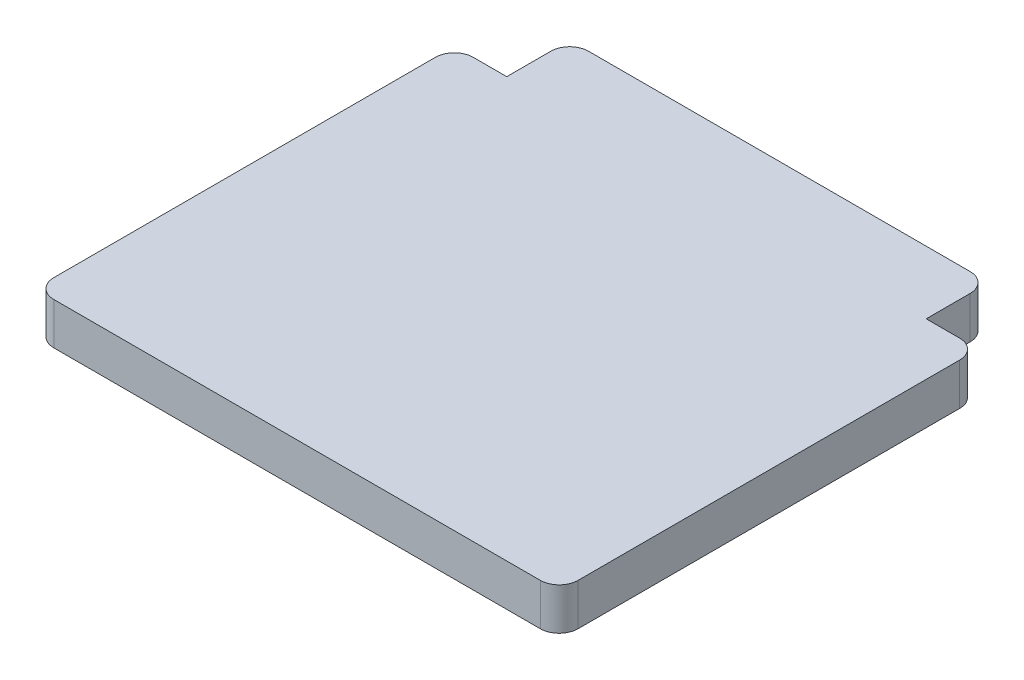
ISO-10303-21;
HEADER;
FILE_DESCRIPTION(('STEP AP214'),'2;1');
FILE_NAME('part.step','',(''),(''),'','','');
FILE_SCHEMA(('AUTOMOTIVE_DESIGN { 1 0 10303 214 1 1 1 1 }'));
ENDSEC;
DATA;
#1=APPLICATION_CONTEXT('core data for automotive mechanical design processes');
#2=APPLICATION_PROTOCOL_DEFINITION('international standard','automotive_design',2000,#1);
#3=PRODUCT_CONTEXT('',#1,'mechanical');
#4=PRODUCT('Part','Part','',(#3));
#5=PRODUCT_RELATED_PRODUCT_CATEGORY('part','',(#4));
#6=PRODUCT_DEFINITION_FORMATION('','',#4);
#7=PRODUCT_DEFINITION_CONTEXT('part definition',#1,'design');
#8=PRODUCT_DEFINITION('design','',#6,#7);
#9=PRODUCT_DEFINITION_SHAPE('','',#8);
#10=(LENGTH_UNIT() NAMED_UNIT(*) SI_UNIT(.MILLI.,.METRE.));
#11=(NAMED_UNIT(*) PLANE_ANGLE_UNIT() SI_UNIT($,.RADIAN.));
#12=(NAMED_UNIT(*) SI_UNIT($,.STERADIAN.) SOLID_ANGLE_UNIT());
#13=UNCERTAINTY_MEASURE_WITH_UNIT(LENGTH_MEASURE(1.E-05),#10,'distance_accuracy_value','');
#14=(GEOMETRIC_REPRESENTATION_CONTEXT(3) GLOBAL_UNCERTAINTY_ASSIGNED_CONTEXT((#13)) GLOBAL_UNIT_ASSIGNED_CONTEXT((#10,
#11,#12)) REPRESENTATION_CONTEXT('',''));
#15=CARTESIAN_POINT('',(0.,0.,0.));
#16=DIRECTION('',(0.,0.,1.));
#17=DIRECTION('',(1.,0.,0.));
#18=AXIS2_PLACEMENT_3D('',#15,#16,#17);
#19=CARTESIAN_POINT('',(0.,2.,-10.));
#20=DIRECTION('',(0.,0.,-1.));
#21=DIRECTION('',(-1.,0.,0.));
#22=AXIS2_PLACEMENT_3D('',#19,#20,#21);
#23=PLANE('',#22);
#24=DIRECTION('',(1.,0.,0.));
#25=VECTOR('',#24,1.);
#26=CARTESIAN_POINT('',(0.,0.,-10.));
#27=LINE('',#26,#25);
#28=CARTESIAN_POINT('',(10.,0.,-10.));
#29=VERTEX_POINT('',#28);
#30=CARTESIAN_POINT('',(11.5997580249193,0.,-10.));
#31=VERTEX_POINT('',#30);
#32=EDGE_CURVE('E164',#29,#31,#27,.T.);
#33=ORIENTED_EDGE('',*,*,#32,.F.);
#34=DIRECTION('',(0.,-1.,0.));
#35=VECTOR('',#34,1.);
#36=CARTESIAN_POINT('',(10.,2.,-10.));
#37=LINE('',#36,#35);
#38=CARTESIAN_POINT('',(10.,2.,-10.));
#39=VERTEX_POINT('',#38);
#40=EDGE_CURVE('E11',#39,#29,#37,.T.);
#41=ORIENTED_EDGE('',*,*,#40,.F.);
#42=DIRECTION('',(1.,0.,0.));
#43=VECTOR('',#42,1.);
#44=CARTESIAN_POINT('',(0.,2.,-10.));
#45=LINE('',#44,#43);
#46=CARTESIAN_POINT('',(11.5997580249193,2.,-10.));
#47=VERTEX_POINT('',#46);
#48=EDGE_CURVE('E195',#39,#47,#45,.T.);
#49=ORIENTED_EDGE('',*,*,#48,.T.);
#50=DIRECTION('',(0.,-1.,0.));
#51=VECTOR('',#50,1.);
#52=CARTESIAN_POINT('',(11.5997580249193,2.,-10.));
#53=LINE('',#52,#51);
#54=EDGE_CURVE('E51',#47,#31,#53,.T.);
#55=ORIENTED_EDGE('',*,*,#54,.T.);
#56=EDGE_LOOP('',(#33,#41,#49,#55));
#57=FACE_BOUND('',#56,.T.);
#58=ADVANCED_FACE('F34',(#57),#23,.T.);
#59=CARTESIAN_POINT('',(10.,2.,0.));
#60=DIRECTION('',(1.,0.,0.));
#61=DIRECTION('',(0.,0.,-1.));
#62=AXIS2_PLACEMENT_3D('',#59,#60,#61);
#63=PLANE('',#62);
#64=DIRECTION('',(0.,0.,1.));
#65=VECTOR('',#64,1.);
#66=CARTESIAN_POINT('',(10.,0.,0.));
#67=LINE('',#66,#65);
#68=CARTESIAN_POINT('',(10.,0.,-12.0997580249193));
#69=VERTEX_POINT('',#68);
#70=EDGE_CURVE('E166',#69,#29,#67,.T.);
#71=ORIENTED_EDGE('',*,*,#70,.F.);
#72=DIRECTION('',(0.,-1.,0.));
#73=VECTOR('',#72,1.);
#74=CARTESIAN_POINT('',(10.,2.,-12.0997580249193));
#75=LINE('',#74,#73);
#76=CARTESIAN_POINT('',(10.,2.,-12.0997580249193));
#77=VERTEX_POINT('',#76);
#78=EDGE_CURVE('E43',#77,#69,#75,.T.);
#79=ORIENTED_EDGE('',*,*,#78,.F.);
#80=DIRECTION('',(0.,0.,1.));
#81=VECTOR('',#80,1.);
#82=CARTESIAN_POINT('',(10.,2.,0.));
#83=LINE('',#82,#81);
#84=EDGE_CURVE('E239',#77,#39,#83,.T.);
#85=ORIENTED_EDGE('',*,*,#84,.T.);
#86=ORIENTED_EDGE('',*,*,#40,.T.);
#87=EDGE_LOOP('',(#71,#79,#85,#86));
#88=FACE_BOUND('',#87,.T.);
#89=ADVANCED_FACE('F36',(#88),#63,.T.);
#90=CARTESIAN_POINT('',(9.09975802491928,2.,-12.0997580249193));
#91=DIRECTION('',(0.,-1.,0.));
#92=DIRECTION('',(0.,0.,-1.));
#93=AXIS2_PLACEMENT_3D('',#90,#91,#92);
#94=CYLINDRICAL_SURFACE('',#93,0.900241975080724);
#95=CARTESIAN_POINT('',(9.09975802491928,0.,-12.0997580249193));
#96=DIRECTION('',(0.,1.,0.));
#97=DIRECTION('',(0.,0.,1.));
#98=AXIS2_PLACEMENT_3D('',#95,#96,#97);
#99=CIRCLE('',#98,0.900241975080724);
#100=CARTESIAN_POINT('',(9.09975802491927,0.,-13.));
#101=VERTEX_POINT('',#100);
#102=EDGE_CURVE('E170',#101,#69,#99,.F.);
#103=ORIENTED_EDGE('',*,*,#102,.F.);
#104=DIRECTION('',(0.,-1.,0.));
#105=VECTOR('',#104,1.);
#106=CARTESIAN_POINT('',(9.09975802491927,2.,-13.));
#107=LINE('',#106,#105);
#108=CARTESIAN_POINT('',(9.09975802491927,2.,-13.));
#109=VERTEX_POINT('',#108);
#110=EDGE_CURVE('E217',#109,#101,#107,.T.);
#111=ORIENTED_EDGE('',*,*,#110,.F.);
#112=CARTESIAN_POINT('',(9.09975802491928,2.,-12.0997580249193));
#113=DIRECTION('',(0.,1.,0.));
#114=DIRECTION('',(0.,0.,1.));
#115=AXIS2_PLACEMENT_3D('',#112,#113,#114);
#116=CIRCLE('',#115,0.900241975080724);
#117=EDGE_CURVE('E224',#109,#77,#116,.F.);
#118=ORIENTED_EDGE('',*,*,#117,.T.);
#119=ORIENTED_EDGE('',*,*,#78,.T.);
#120=EDGE_LOOP('',(#103,#111,#118,#119));
#121=FACE_BOUND('',#120,.T.);
#122=ADVANCED_FACE('F222',(#121),#94,.T.);
#123=CARTESIAN_POINT('',(0.,2.,-13.));
#124=DIRECTION('',(0.,0.,-1.));
#125=DIRECTION('',(-1.,0.,0.));
#126=AXIS2_PLACEMENT_3D('',#123,#124,#125);
#127=PLANE('',#126);
#128=DIRECTION('',(1.,0.,0.));
#129=VECTOR('',#128,1.);
#130=CARTESIAN_POINT('',(0.,0.,-13.));
#131=LINE('',#130,#129);
#132=CARTESIAN_POINT('',(-9.09975802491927,0.,-13.));
#133=VERTEX_POINT('',#132);
#134=EDGE_CURVE('E173',#133,#101,#131,.T.);
#135=ORIENTED_EDGE('',*,*,#134,.F.);
#136=DIRECTION('',(0.,-1.,0.));
#137=VECTOR('',#136,1.);
#138=CARTESIAN_POINT('',(-9.09975802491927,2.,-13.));
#139=LINE('',#138,#137);
#140=CARTESIAN_POINT('',(-9.09975802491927,2.,-13.));
#141=VERTEX_POINT('',#140);
#142=EDGE_CURVE('E215',#141,#133,#139,.T.);
#143=ORIENTED_EDGE('',*,*,#142,.F.);
#144=DIRECTION('',(1.,0.,0.));
#145=VECTOR('',#144,1.);
#146=CARTESIAN_POINT('',(0.,2.,-13.));
#147=LINE('',#146,#145);
#148=EDGE_CURVE('E238',#141,#109,#147,.T.);
#149=ORIENTED_EDGE('',*,*,#148,.T.);
#150=ORIENTED_EDGE('',*,*,#110,.T.);
#151=EDGE_LOOP('',(#135,#143,#149,#150));
#152=FACE_BOUND('',#151,.T.);
#153=ADVANCED_FACE('F234',(#152),#127,.T.);
#154=CARTESIAN_POINT('',(-9.09975802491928,2.,-12.0997580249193));
#155=DIRECTION('',(0.,-1.,0.));
#156=DIRECTION('',(0.,0.,-1.));
#157=AXIS2_PLACEMENT_3D('',#154,#155,#156);
#158=CYLINDRICAL_SURFACE('',#157,0.900241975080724);
#159=CARTESIAN_POINT('',(-9.09975802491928,0.,-12.0997580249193));
#160=DIRECTION('',(0.,1.,0.));
#161=DIRECTION('',(0.,0.,1.));
#162=AXIS2_PLACEMENT_3D('',#159,#160,#161);
#163=CIRCLE('',#162,0.900241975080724);
#164=CARTESIAN_POINT('',(-10.,0.,-12.0997580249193));
#165=VERTEX_POINT('',#164);
#166=EDGE_CURVE('E176',#133,#165,#163,.T.);
#167=ORIENTED_EDGE('',*,*,#166,.T.);
#168=DIRECTION('',(0.,-1.,0.));
#169=VECTOR('',#168,1.);
#170=CARTESIAN_POINT('',(-10.,2.,-12.0997580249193));
#171=LINE('',#170,#169);
#172=CARTESIAN_POINT('',(-10.,2.,-12.0997580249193));
#173=VERTEX_POINT('',#172);
#174=EDGE_CURVE('E212',#173,#165,#171,.T.);
#175=ORIENTED_EDGE('',*,*,#174,.F.);
#176=CARTESIAN_POINT('',(-9.09975802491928,2.,-12.0997580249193));
#177=DIRECTION('',(0.,1.,0.));
#178=DIRECTION('',(0.,0.,1.));
#179=AXIS2_PLACEMENT_3D('',#176,#177,#178);
#180=CIRCLE('',#179,0.900241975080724);
#181=EDGE_CURVE('E241',#141,#173,#180,.T.);
#182=ORIENTED_EDGE('',*,*,#181,.F.);
#183=ORIENTED_EDGE('',*,*,#142,.T.);
#184=EDGE_LOOP('',(#167,#175,#182,#183));
#185=FACE_BOUND('',#184,.T.);
#186=ADVANCED_FACE('F293',(#185),#158,.T.);
#187=CARTESIAN_POINT('',(-10.,2.,0.));
#188=DIRECTION('',(1.,0.,0.));
#189=DIRECTION('',(0.,0.,-1.));
#190=AXIS2_PLACEMENT_3D('',#187,#188,#189);
#191=PLANE('',#190);
#192=DIRECTION('',(0.,0.,1.));
#193=VECTOR('',#192,1.);
#194=CARTESIAN_POINT('',(-10.,0.,0.));
#195=LINE('',#194,#193);
#196=CARTESIAN_POINT('',(-10.,0.,-10.));
#197=VERTEX_POINT('',#196);
#198=EDGE_CURVE('E178',#165,#197,#195,.T.);
#199=ORIENTED_EDGE('',*,*,#198,.T.);
#200=DIRECTION('',(0.,-1.,0.));
#201=VECTOR('',#200,1.);
#202=CARTESIAN_POINT('',(-10.,2.,-10.));
#203=LINE('',#202,#201);
#204=CARTESIAN_POINT('',(-10.,2.,-10.));
#205=VERTEX_POINT('',#204);
#206=EDGE_CURVE('E210',#205,#197,#203,.T.);
#207=ORIENTED_EDGE('',*,*,#206,.F.);
#208=DIRECTION('',(0.,0.,1.));
#209=VECTOR('',#208,1.);
#210=CARTESIAN_POINT('',(-10.,2.,0.));
#211=LINE('',#210,#209);
#212=EDGE_CURVE('E247',#173,#205,#211,.T.);
#213=ORIENTED_EDGE('',*,*,#212,.F.);
#214=ORIENTED_EDGE('',*,*,#174,.T.);
#215=EDGE_LOOP('',(#199,#207,#213,#214));
#216=FACE_BOUND('',#215,.T.);
#217=ADVANCED_FACE('F285',(#216),#191,.F.);
#218=CARTESIAN_POINT('',(-11.5997580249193,0.,-10.));
#219=VERTEX_POINT('',#218);
#220=EDGE_CURVE('E167',#219,#197,#27,.T.);
#221=ORIENTED_EDGE('',*,*,#220,.F.);
#222=DIRECTION('',(0.,-1.,0.));
#223=VECTOR('',#222,1.);
#224=CARTESIAN_POINT('',(-11.5997580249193,2.,-10.));
#225=LINE('',#224,#223);
#226=CARTESIAN_POINT('',(-11.5997580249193,2.,-10.));
#227=VERTEX_POINT('',#226);
#228=EDGE_CURVE('E208',#227,#219,#225,.T.);
#229=ORIENTED_EDGE('',*,*,#228,.F.);
#230=EDGE_CURVE('E249',#227,#205,#45,.T.);
#231=ORIENTED_EDGE('',*,*,#230,.T.);
#232=ORIENTED_EDGE('',*,*,#206,.T.);
#233=EDGE_LOOP('',(#221,#229,#231,#232));
#234=FACE_BOUND('',#233,.T.);
#235=ADVANCED_FACE('F277',(#234),#23,.T.);
#236=CARTESIAN_POINT('',(-11.5997580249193,2.,-9.09975802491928));
#237=DIRECTION('',(0.,-1.,0.));
#238=DIRECTION('',(0.,0.,-1.));
#239=AXIS2_PLACEMENT_3D('',#236,#237,#238);
#240=CYLINDRICAL_SURFACE('',#239,0.900241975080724);
#241=CARTESIAN_POINT('',(-11.5997580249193,0.,-9.09975802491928));
#242=DIRECTION('',(0.,1.,0.));
#243=DIRECTION('',(0.,0.,1.));
#244=AXIS2_PLACEMENT_3D('',#241,#242,#243);
#245=CIRCLE('',#244,0.900241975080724);
#246=CARTESIAN_POINT('',(-12.5,0.,-9.09975802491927));
#247=VERTEX_POINT('',#246);
#248=EDGE_CURVE('E181',#219,#247,#245,.T.);
#249=ORIENTED_EDGE('',*,*,#248,.T.);
#250=DIRECTION('',(0.,-1.,0.));
#251=VECTOR('',#250,1.);
#252=CARTESIAN_POINT('',(-12.5,2.,-9.09975802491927));
#253=LINE('',#252,#251);
#254=CARTESIAN_POINT('',(-12.5,2.,-9.09975802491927));
#255=VERTEX_POINT('',#254);
#256=EDGE_CURVE('E205',#255,#247,#253,.T.);
#257=ORIENTED_EDGE('',*,*,#256,.F.);
#258=CARTESIAN_POINT('',(-11.5997580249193,2.,-9.09975802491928));
#259=DIRECTION('',(0.,1.,0.));
#260=DIRECTION('',(0.,0.,1.));
#261=AXIS2_PLACEMENT_3D('',#258,#259,#260);
#262=CIRCLE('',#261,0.900241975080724);
#263=EDGE_CURVE('E250',#227,#255,#262,.T.);
#264=ORIENTED_EDGE('',*,*,#263,.F.);
#265=ORIENTED_EDGE('',*,*,#228,.T.);
#266=EDGE_LOOP('',(#249,#257,#264,#265));
#267=FACE_BOUND('',#266,.T.);
#268=ADVANCED_FACE('F284',(#267),#240,.T.);
#269=CARTESIAN_POINT('',(-12.5,2.,0.));
#270=DIRECTION('',(1.,0.,0.));
#271=DIRECTION('',(0.,0.,-1.));
#272=AXIS2_PLACEMENT_3D('',#269,#270,#271);
#273=PLANE('',#272);
#274=DIRECTION('',(0.,0.,1.));
#275=VECTOR('',#274,1.);
#276=CARTESIAN_POINT('',(-12.5,0.,0.));
#277=LINE('',#276,#275);
#278=CARTESIAN_POINT('',(-12.5,0.,9.09975802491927));
#279=VERTEX_POINT('',#278);
#280=EDGE_CURVE('E183',#247,#279,#277,.T.);
#281=ORIENTED_EDGE('',*,*,#280,.T.);
#282=DIRECTION('',(0.,-1.,0.));
#283=VECTOR('',#282,1.);
#284=CARTESIAN_POINT('',(-12.5,2.,9.09975802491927));
#285=LINE('',#284,#283);
#286=CARTESIAN_POINT('',(-12.5,2.,9.09975802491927));
#287=VERTEX_POINT('',#286);
#288=EDGE_CURVE('E202',#287,#279,#285,.T.);
#289=ORIENTED_EDGE('',*,*,#288,.F.);
#290=DIRECTION('',(0.,0.,1.));
#291=VECTOR('',#290,1.);
#292=CARTESIAN_POINT('',(-12.5,2.,0.));
#293=LINE('',#292,#291);
#294=EDGE_CURVE('E252',#255,#287,#293,.T.);
#295=ORIENTED_EDGE('',*,*,#294,.F.);
#296=ORIENTED_EDGE('',*,*,#256,.T.);
#297=EDGE_LOOP('',(#281,#289,#295,#296));
#298=FACE_BOUND('',#297,.T.);
#299=ADVANCED_FACE('F291',(#298),#273,.F.);
#300=CARTESIAN_POINT('',(-11.5997580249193,2.,9.09975802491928));
#301=DIRECTION('',(0.,-1.,0.));
#302=DIRECTION('',(0.,0.,-1.));
#303=AXIS2_PLACEMENT_3D('',#300,#301,#302);
#304=CYLINDRICAL_SURFACE('',#303,0.900241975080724);
#305=CARTESIAN_POINT('',(-11.5997580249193,0.,9.09975802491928));
#306=DIRECTION('',(0.,1.,0.));
#307=DIRECTION('',(0.,0.,1.));
#308=AXIS2_PLACEMENT_3D('',#305,#306,#307);
#309=CIRCLE('',#308,0.900241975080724);
#310=CARTESIAN_POINT('',(-11.5997580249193,0.,10.));
#311=VERTEX_POINT('',#310);
#312=EDGE_CURVE('E185',#279,#311,#309,.T.);
#313=ORIENTED_EDGE('',*,*,#312,.T.);
#314=DIRECTION('',(0.,-1.,0.));
#315=VECTOR('',#314,1.);
#316=CARTESIAN_POINT('',(-11.5997580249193,2.,10.));
#317=LINE('',#316,#315);
#318=CARTESIAN_POINT('',(-11.5997580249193,2.,10.));
#319=VERTEX_POINT('',#318);
#320=EDGE_CURVE('E199',#319,#311,#317,.T.);
#321=ORIENTED_EDGE('',*,*,#320,.F.);
#322=CARTESIAN_POINT('',(-11.5997580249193,2.,9.09975802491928));
#323=DIRECTION('',(0.,1.,0.));
#324=DIRECTION('',(0.,0.,1.));
#325=AXIS2_PLACEMENT_3D('',#322,#323,#324);
#326=CIRCLE('',#325,0.900241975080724);
#327=EDGE_CURVE('E254',#287,#319,#326,.T.);
#328=ORIENTED_EDGE('',*,*,#327,.F.);
#329=ORIENTED_EDGE('',*,*,#288,.T.);
#330=EDGE_LOOP('',(#313,#321,#328,#329));
#331=FACE_BOUND('',#330,.T.);
#332=ADVANCED_FACE('F260',(#331),#304,.T.);
#333=CARTESIAN_POINT('',(0.,2.,10.));
#334=DIRECTION('',(0.,0.,-1.));
#335=DIRECTION('',(-1.,0.,0.));
#336=AXIS2_PLACEMENT_3D('',#333,#334,#335);
#337=PLANE('',#336);
#338=DIRECTION('',(1.,0.,0.));
#339=VECTOR('',#338,1.);
#340=CARTESIAN_POINT('',(0.,0.,10.));
#341=LINE('',#340,#339);
#342=CARTESIAN_POINT('',(11.5997580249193,0.,10.));
#343=VERTEX_POINT('',#342);
#344=EDGE_CURVE('E187',#311,#343,#341,.T.);
#345=ORIENTED_EDGE('',*,*,#344,.T.);
#346=DIRECTION('',(0.,-1.,0.));
#347=VECTOR('',#346,1.);
#348=CARTESIAN_POINT('',(11.5997580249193,2.,10.));
#349=LINE('',#348,#347);
#350=CARTESIAN_POINT('',(11.5997580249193,2.,10.));
#351=VERTEX_POINT('',#350);
#352=EDGE_CURVE('E156',#351,#343,#349,.T.);
#353=ORIENTED_EDGE('',*,*,#352,.F.);
#354=DIRECTION('',(1.,0.,0.));
#355=VECTOR('',#354,1.);
#356=CARTESIAN_POINT('',(0.,2.,10.));
#357=LINE('',#356,#355);
#358=EDGE_CURVE('E144',#319,#351,#357,.T.);
#359=ORIENTED_EDGE('',*,*,#358,.F.);
#360=ORIENTED_EDGE('',*,*,#320,.T.);
#361=EDGE_LOOP('',(#345,#353,#359,#360));
#362=FACE_BOUND('',#361,.T.);
#363=ADVANCED_FACE('F264',(#362),#337,.F.);
#364=CARTESIAN_POINT('',(11.5997580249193,2.,9.09975802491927));
#365=DIRECTION('',(0.,-1.,0.));
#366=DIRECTION('',(0.,0.,-1.));
#367=AXIS2_PLACEMENT_3D('',#364,#365,#366);
#368=CYLINDRICAL_SURFACE('',#367,0.900241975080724);
#369=CARTESIAN_POINT('',(11.5997580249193,0.,9.09975802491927));
#370=DIRECTION('',(0.,1.,0.));
#371=DIRECTION('',(0.,0.,1.));
#372=AXIS2_PLACEMENT_3D('',#369,#370,#371);
#373=CIRCLE('',#372,0.900241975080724);
#374=CARTESIAN_POINT('',(12.5,0.,9.09975802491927));
#375=VERTEX_POINT('',#374);
#376=EDGE_CURVE('E153',#343,#375,#373,.T.);
#377=ORIENTED_EDGE('',*,*,#376,.T.);
#378=DIRECTION('',(0.,-1.,0.));
#379=VECTOR('',#378,1.);
#380=CARTESIAN_POINT('',(12.5,2.,9.09975802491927));
#381=LINE('',#380,#379);
#382=CARTESIAN_POINT('',(12.5,2.,9.09975802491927));
#383=VERTEX_POINT('',#382);
#384=EDGE_CURVE('E150',#383,#375,#381,.T.);
#385=ORIENTED_EDGE('',*,*,#384,.F.);
#386=CARTESIAN_POINT('',(11.5997580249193,2.,9.09975802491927));
#387=DIRECTION('',(0.,1.,0.));
#388=DIRECTION('',(0.,0.,1.));
#389=AXIS2_PLACEMENT_3D('',#386,#387,#388);
#390=CIRCLE('',#389,0.900241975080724);
#391=EDGE_CURVE('E137',#351,#383,#390,.T.);
#392=ORIENTED_EDGE('',*,*,#391,.F.);
#393=ORIENTED_EDGE('',*,*,#352,.T.);
#394=EDGE_LOOP('',(#377,#385,#392,#393));
#395=FACE_BOUND('',#394,.T.);
#396=ADVANCED_FACE('F151',(#395),#368,.T.);
#397=CARTESIAN_POINT('',(12.5,2.,0.));
#398=DIRECTION('',(1.,0.,0.));
#399=DIRECTION('',(0.,0.,-1.));
#400=AXIS2_PLACEMENT_3D('',#397,#398,#399);
#401=PLANE('',#400);
#402=DIRECTION('',(0.,0.,1.));
#403=VECTOR('',#402,1.);
#404=CARTESIAN_POINT('',(12.5,0.,0.));
#405=LINE('',#404,#403);
#406=CARTESIAN_POINT('',(12.5,0.,-9.09975802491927));
#407=VERTEX_POINT('',#406);
#408=EDGE_CURVE('E190',#407,#375,#405,.T.);
#409=ORIENTED_EDGE('',*,*,#408,.F.);
#410=DIRECTION('',(0.,-1.,0.));
#411=VECTOR('',#410,1.);
#412=CARTESIAN_POINT('',(12.5,2.,-9.09975802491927));
#413=LINE('',#412,#411);
#414=CARTESIAN_POINT('',(12.5,2.,-9.09975802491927));
#415=VERTEX_POINT('',#414);
#416=EDGE_CURVE('E94',#415,#407,#413,.T.);
#417=ORIENTED_EDGE('',*,*,#416,.F.);
#418=DIRECTION('',(0.,0.,1.));
#419=VECTOR('',#418,1.);
#420=CARTESIAN_POINT('',(12.5,2.,0.));
#421=LINE('',#420,#419);
#422=EDGE_CURVE('E142',#415,#383,#421,.T.);
#423=ORIENTED_EDGE('',*,*,#422,.T.);
#424=ORIENTED_EDGE('',*,*,#384,.T.);
#425=EDGE_LOOP('',(#409,#417,#423,#424));
#426=FACE_BOUND('',#425,.T.);
#427=ADVANCED_FACE('F158',(#426),#401,.T.);
#428=CARTESIAN_POINT('',(11.5997580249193,2.,-9.09975802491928));
#429=DIRECTION('',(0.,-1.,0.));
#430=DIRECTION('',(0.,0.,-1.));
#431=AXIS2_PLACEMENT_3D('',#428,#429,#430);
#432=CYLINDRICAL_SURFACE('',#431,0.900241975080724);
#433=CARTESIAN_POINT('',(11.5997580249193,0.,-9.09975802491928));
#434=DIRECTION('',(0.,1.,0.));
#435=DIRECTION('',(0.,0.,1.));
#436=AXIS2_PLACEMENT_3D('',#433,#434,#435);
#437=CIRCLE('',#436,0.900241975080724);
#438=EDGE_CURVE('E192',#31,#407,#437,.F.);
#439=ORIENTED_EDGE('',*,*,#438,.F.);
#440=ORIENTED_EDGE('',*,*,#54,.F.);
#441=CARTESIAN_POINT('',(11.5997580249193,2.,-9.09975802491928));
#442=DIRECTION('',(0.,1.,0.));
#443=DIRECTION('',(0.,0.,1.));
#444=AXIS2_PLACEMENT_3D('',#441,#442,#443);
#445=CIRCLE('',#444,0.900241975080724);
#446=EDGE_CURVE('E159',#47,#415,#445,.F.);
#447=ORIENTED_EDGE('',*,*,#446,.T.);
#448=ORIENTED_EDGE('',*,*,#416,.T.);
#449=EDGE_LOOP('',(#439,#440,#447,#448));
#450=FACE_BOUND('',#449,.T.);
#451=ADVANCED_FACE('F265',(#450),#432,.T.);
#452=CARTESIAN_POINT('',(0.,2.,0.));
#453=DIRECTION('',(0.,1.,0.));
#454=DIRECTION('',(0.,0.,1.));
#455=AXIS2_PLACEMENT_3D('',#452,#453,#454);
#456=PLANE('',#455);
#457=ORIENTED_EDGE('',*,*,#48,.F.);
#458=ORIENTED_EDGE('',*,*,#84,.F.);
#459=ORIENTED_EDGE('',*,*,#117,.F.);
#460=ORIENTED_EDGE('',*,*,#148,.F.);
#461=ORIENTED_EDGE('',*,*,#181,.T.);
#462=ORIENTED_EDGE('',*,*,#212,.T.);
#463=ORIENTED_EDGE('',*,*,#230,.F.);
#464=ORIENTED_EDGE('',*,*,#263,.T.);
#465=ORIENTED_EDGE('',*,*,#294,.T.);
#466=ORIENTED_EDGE('',*,*,#327,.T.);
#467=ORIENTED_EDGE('',*,*,#358,.T.);
#468=ORIENTED_EDGE('',*,*,#391,.T.);
#469=ORIENTED_EDGE('',*,*,#422,.F.);
#470=ORIENTED_EDGE('',*,*,#446,.F.);
#471=EDGE_LOOP('',(#457,#458,#459,#460,#461,#462,#463,#464,#465,#466,#467,#468,#469,#470));
#472=FACE_BOUND('',#471,.T.);
#473=ADVANCED_FACE('F139',(#472),#456,.T.);
#474=CARTESIAN_POINT('',(0.,0.,0.));
#475=DIRECTION('',(0.,1.,0.));
#476=DIRECTION('',(0.,0.,1.));
#477=AXIS2_PLACEMENT_3D('',#474,#475,#476);
#478=PLANE('',#477);
#479=ORIENTED_EDGE('',*,*,#32,.T.);
#480=ORIENTED_EDGE('',*,*,#438,.T.);
#481=ORIENTED_EDGE('',*,*,#408,.T.);
#482=ORIENTED_EDGE('',*,*,#376,.F.);
#483=ORIENTED_EDGE('',*,*,#344,.F.);
#484=ORIENTED_EDGE('',*,*,#312,.F.);
#485=ORIENTED_EDGE('',*,*,#280,.F.);
#486=ORIENTED_EDGE('',*,*,#248,.F.);
#487=ORIENTED_EDGE('',*,*,#220,.T.);
#488=ORIENTED_EDGE('',*,*,#198,.F.);
#489=ORIENTED_EDGE('',*,*,#166,.F.);
#490=ORIENTED_EDGE('',*,*,#134,.T.);
#491=ORIENTED_EDGE('',*,*,#102,.T.);
#492=ORIENTED_EDGE('',*,*,#70,.T.);
#493=EDGE_LOOP('',(#479,#480,#481,#482,#483,#484,#485,#486,#487,#488,#489,#490,#491,#492));
#494=FACE_BOUND('',#493,.T.);
#495=ADVANCED_FACE('F229',(#494),#478,.F.);
#496=CLOSED_SHELL('',(#58,#89,#122,#153,#186,#217,#235,#268,#299,#332,#363,#396,#427,#451,#473,#495));
#497=MANIFOLD_SOLID_BREP('B2',#496);
#498=ADVANCED_BREP_SHAPE_REPRESENTATION('',(#18,#497),#14);
#499=SHAPE_DEFINITION_REPRESENTATION(#9,#498);
ENDSEC;
END-ISO-10303-21;
